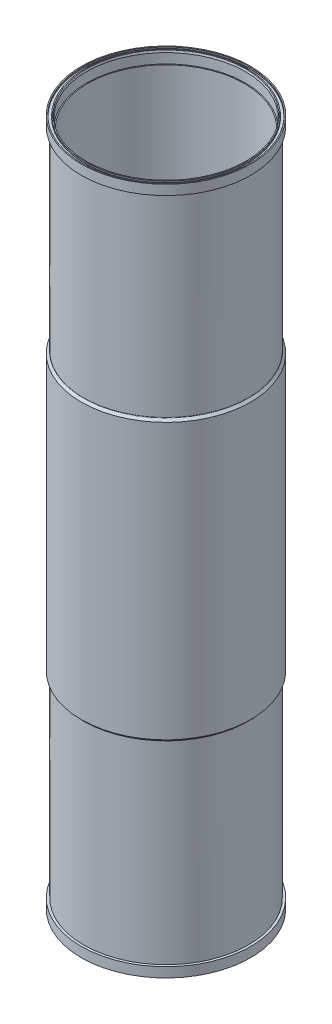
from build123d import *

# Parameters (mm, degrees)
SKETCH4_W = 3.0988
SKETCH4_H = 863.6


with BuildPart() as part:
    # Sketch1 → Revolve1 (revolve)
    with BuildSketch(Plane.XY, mode=Mode.PRIVATE) as revolve1_sk:
        Polygon((-109.5375, 889), (-103.309290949, 889), (-102.6287, 886.46), (-102.6287, 873.76), (-101.3587, 873.76), (-101.3587, 15.24), (-102.6287, 15.24), (-102.6287, 2.54), (-103.309290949, 0), (-109.5375, 0), align=None)
    revolve(revolve1_sk.sketch.rotate(Axis((0, 0, 0), (0, 1, 0)), 270), axis=Axis((0, 0, 0), (0, 1, 0)))

    # Sketch4 → Cut-Revolve2 (revolve, cut)
    with BuildSketch(Plane.XY, mode=Mode.PRIVATE) as cut_revolve2_sk:
        with Locations((-107.9881, 444.5)):
            Rectangle(SKETCH4_W, SKETCH4_H)
    revolve(cut_revolve2_sk.sketch.rotate(Axis((0, 880.11, 0), (0, -1, 0)), 90), axis=Axis((0, 880.11, 0), (0, -1, 0)), mode=Mode.SUBTRACT)

    # Sketch8 → Revolve2 (revolve)
    with BuildSketch(Plane.XY, mode=Mode.PRIVATE) as revolve2_sk:
        with BuildLine():
            Line((-109.5375, 266.7), (-106.671183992, 263.833683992))
            ThreePointArc((-106.671183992, 263.833683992), (-106.499120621, 263.576172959), (-106.4387, 263.272417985))
            Line((-106.4387, 263.272417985), (-106.4387, 625.727582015))
            ThreePointArc((-106.4387, 625.727582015), (-106.499120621, 625.423827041), (-106.671183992, 625.166316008))
            Line((-106.671183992, 625.166316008), (-109.5375, 622.3))
            Line((-109.5375, 622.3), (-109.5375, 266.7))
        make_face()
    revolve(revolve2_sk.sketch.rotate(Axis((0, 12.7, 0), (0, 1, 0)), 270), axis=Axis((0, 12.7, 0), (0, 1, 0)))

    # Sketch5 → 2-172 O-Ring (revolve, cut)
    with BuildSketch(Plane.XY, mode=Mode.PRIVATE) as f_2_172_o_ring_sk:
        with BuildLine():
            Line((-108.2675, 889), (-104.4829, 889))
            ThreePointArc((-104.4829, 889), (-104.572702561, 888.962802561), (-104.6099, 888.873))
            Line((-104.6099, 888.873), (-104.6099, 887.2982))
            ThreePointArc((-104.6099, 887.2982), (-104.684294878, 887.118594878), (-104.8639, 887.0442))
            Line((-104.8639, 887.0442), (-107.8865, 887.0442))
            ThreePointArc((-107.8865, 887.0442), (-108.066105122, 887.118594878), (-108.1405, 887.2982))
            Line((-108.1405, 887.2982), (-108.1405, 888.873))
            ThreePointArc((-108.1405, 888.873), (-108.177697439, 888.962802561), (-108.2675, 889))
        make_face()
    f_2_172_o_ring = revolve(f_2_172_o_ring_sk.sketch.rotate(Axis((0, 0, 0), (0, 1, 0)), 270), axis=Axis((0, 0, 0), (0, 1, 0)), mode=Mode.SUBTRACT)

    # Mirror1: 2-172 O-Ring across plane
    add(f_2_172_o_ring.mirror(Plane.ZX.offset(444.5)), mode=Mode.SUBTRACT)


solid = part.part
